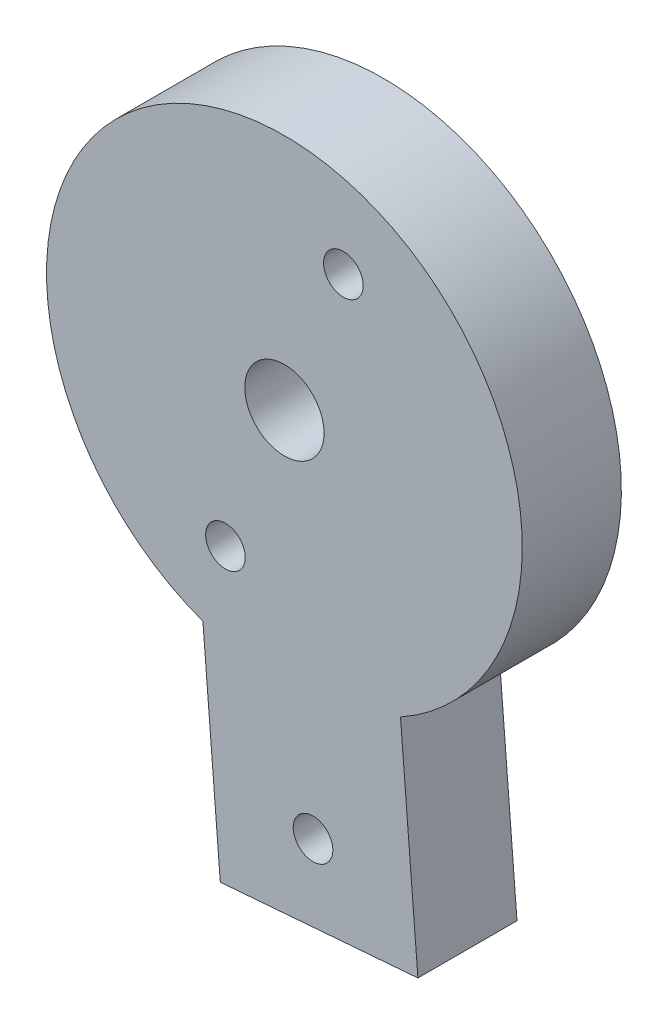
from build123d import *

# Parameters (mm, degrees)
BOSS_EXTRUDE1_DEPTH = 5
SKETCH2_R           = 2
SKETCH2_R_2         = 1
CUT_EXTRUDE1_DEPTH  = 5
SKETCH3_R           = 1
CUT_EXTRUDE2_DEPTH  = 5


with BuildPart() as part:
    # Sketch1 → Boss-Extrude1 (new body)
    with BuildSketch(Plane.XY):
        with BuildLine():
            Line((-4.112372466, -11.273348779), (-3.23343759, -22.23817771))
            Line((-3.23343759, -22.23817771), (6.734588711, -21.439146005))
            Line((6.734588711, -21.439146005), (5.855653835, -10.474317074))
            ThreePointArc((5.855653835, -10.474317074), (-0.958838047, 11.961631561), (-4.112372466, -11.273348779))
        make_face()
    extrude(amount=BOSS_EXTRUDE1_DEPTH)

    # Sketch2 → Cut-Extrude1 (cut)
    with BuildSketch(Plane.XY.offset(5)):
        Circle(SKETCH2_R)
        with Locations((1.443123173, -18.003152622)):
            Circle(SKETCH2_R_2)
    extrude(amount=-CUT_EXTRUDE1_DEPTH, mode=Mode.SUBTRACT)

    # Sketch3 → Cut-Extrude2 (cut)
    with BuildSketch(Plane.XY.offset(5)):
        with Locations((2.974831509, 7.426330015)):
            Circle(SKETCH3_R)
        with Locations((-2.974831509, -7.426330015)):
            Circle(SKETCH3_R)
    extrude(amount=-CUT_EXTRUDE2_DEPTH, mode=Mode.SUBTRACT)


solid = part.part
